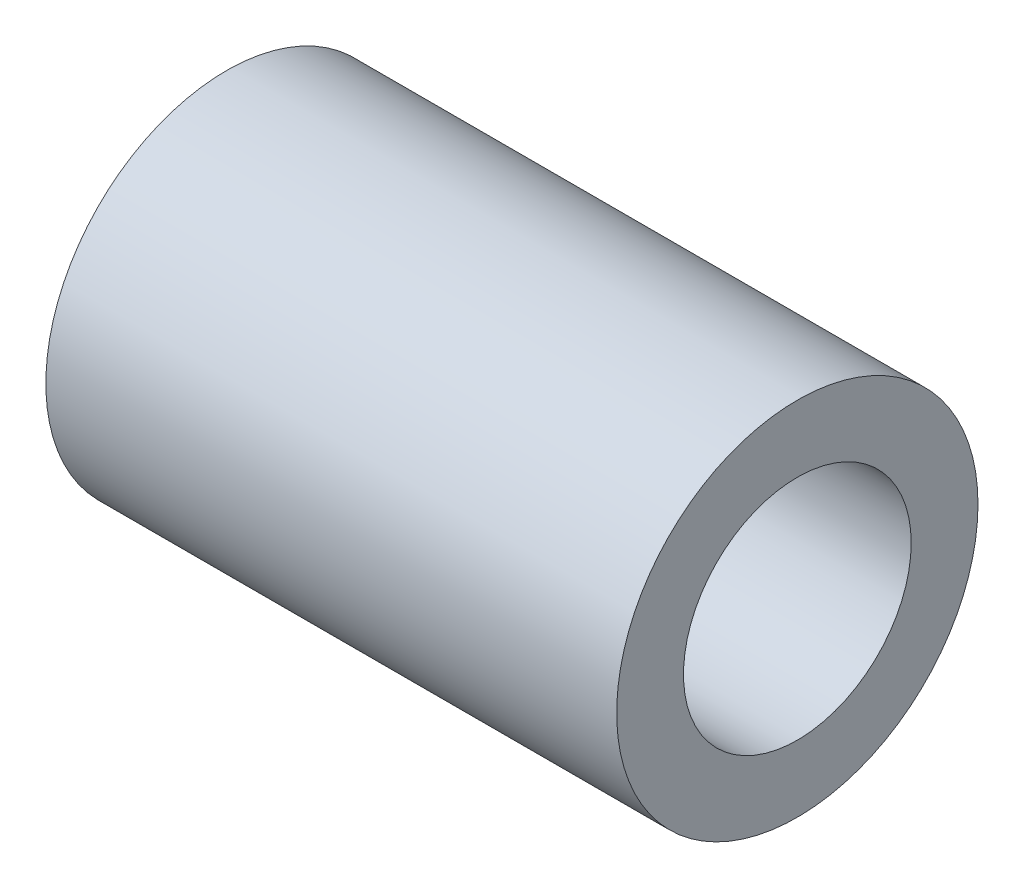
from build123d import *

# Parameters (mm, degrees)
SKETCH1_R      = 15.113
SKETCH1_R_2    = 9.525
EXTRUDE1_DEPTH = 23.876


with BuildPart() as part:
    # Sketch1 → Extrude1 (new, symmetric)
    with BuildSketch(Plane(origin=(0, 0, 0), x_dir=(0, 0, -1), z_dir=(1, 0, 0))):
        Circle(SKETCH1_R)
        Circle(SKETCH1_R_2, mode=Mode.SUBTRACT)
    extrude(amount=EXTRUDE1_DEPTH, both=True)


solid = part.part
